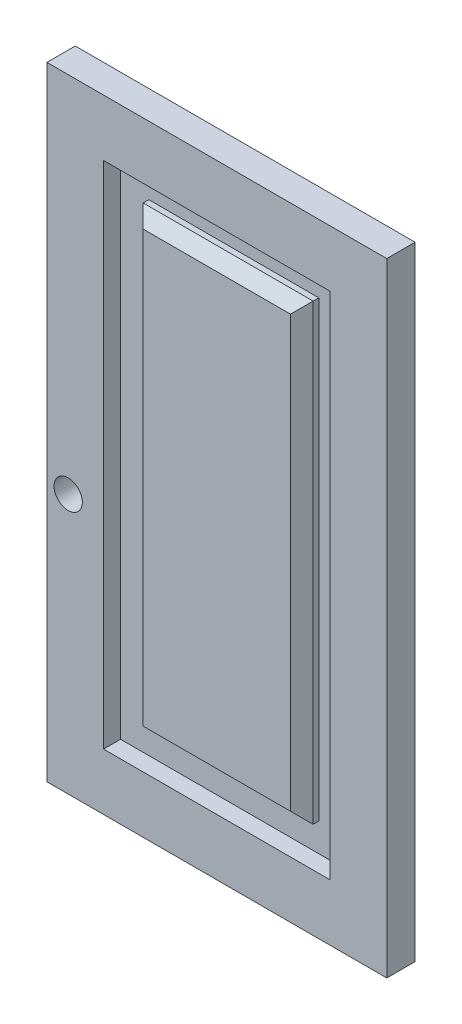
from build123d import *

# Parameters (mm, degrees)
SKETCH1_W          = 60
SKETCH1_H          = 110
BASE_EXTRUDE_DEPTH = 5
SKETCH2_R          = 2.5
CUT_EXTRUDE1_DEPTH = 5
SKETCH3_W          = 40
SKETCH3_H          = 90
SKETCH3_W_2        = 30
SKETCH3_H_2        = 80
CUT_EXTRUDE3_DEPTH = 3
CHAMFER1_SIZE      = 2


with BuildPart() as part:
    # Sketch1 → Base-Extrude (new body)
    with BuildSketch(Plane.XY):
        with Locations((30, 55)):
            Rectangle(SKETCH1_W, SKETCH1_H)
    extrude(amount=-BASE_EXTRUDE_DEPTH)

    # Sketch2 → Cut-Extrude1 (cut)
    with BuildSketch(Plane(origin=(-46.244003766, -4.149669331, 0), x_dir=(1, 0, 0), z_dir=(0, 0, 1))):
        with Locations((50, 50)):
            Circle(SKETCH2_R)
    extrude(amount=-CUT_EXTRUDE1_DEPTH, mode=Mode.SUBTRACT)

    # Sketch3 → Cut-Extrude3 (cut)
    with BuildSketch(Plane.XY):
        with Locations((30, 55)):
            Rectangle(SKETCH3_W, SKETCH3_H)
        with Locations((30, 55)):
            Rectangle(SKETCH3_W_2, SKETCH3_H_2, mode=Mode.SUBTRACT)
    extrude(amount=-CUT_EXTRUDE3_DEPTH, mode=Mode.SUBTRACT)

    # Chamfer1
    chamfer1_edges = [part.edges().sort_by_distance(p)[0] for p in [
        (30, 95, 0),
        (45, 55, 0),
        (30, 15, 0),
        (15, 55, 0),
    ]]
    chamfer(chamfer1_edges, length=CHAMFER1_SIZE)


solid = part.part
